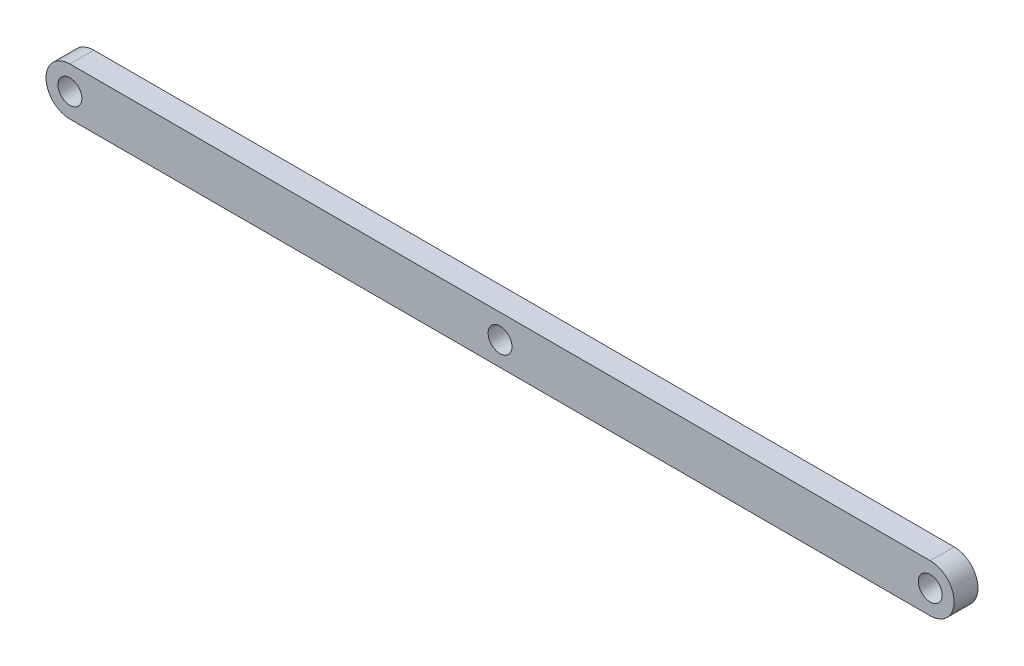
ISO-10303-21;
HEADER;
FILE_DESCRIPTION(('STEP AP214'),'2;1');
FILE_NAME('part.step','',(''),(''),'','','');
FILE_SCHEMA(('AUTOMOTIVE_DESIGN { 1 0 10303 214 1 1 1 1 }'));
ENDSEC;
DATA;
#1=APPLICATION_CONTEXT('core data for automotive mechanical design processes');
#2=APPLICATION_PROTOCOL_DEFINITION('international standard','automotive_design',2000,#1);
#3=PRODUCT_CONTEXT('',#1,'mechanical');
#4=PRODUCT('Part','Part','',(#3));
#5=PRODUCT_RELATED_PRODUCT_CATEGORY('part','',(#4));
#6=PRODUCT_DEFINITION_FORMATION('','',#4);
#7=PRODUCT_DEFINITION_CONTEXT('part definition',#1,'design');
#8=PRODUCT_DEFINITION('design','',#6,#7);
#9=PRODUCT_DEFINITION_SHAPE('','',#8);
#10=(LENGTH_UNIT() NAMED_UNIT(*) SI_UNIT(.MILLI.,.METRE.));
#11=(NAMED_UNIT(*) PLANE_ANGLE_UNIT() SI_UNIT($,.RADIAN.));
#12=(NAMED_UNIT(*) SI_UNIT($,.STERADIAN.) SOLID_ANGLE_UNIT());
#13=UNCERTAINTY_MEASURE_WITH_UNIT(LENGTH_MEASURE(1.E-05),#10,'distance_accuracy_value','');
#14=(GEOMETRIC_REPRESENTATION_CONTEXT(3) GLOBAL_UNCERTAINTY_ASSIGNED_CONTEXT((#13)) GLOBAL_UNIT_ASSIGNED_CONTEXT((#10,
#11,#12)) REPRESENTATION_CONTEXT('',''));
#15=CARTESIAN_POINT('',(0.,0.,0.));
#16=DIRECTION('',(0.,0.,1.));
#17=DIRECTION('',(1.,0.,0.));
#18=AXIS2_PLACEMENT_3D('',#15,#16,#17);
#19=CARTESIAN_POINT('',(0.,0.,3.175));
#20=DIRECTION('',(0.,0.,1.));
#21=DIRECTION('',(1.,0.,0.));
#22=AXIS2_PLACEMENT_3D('',#19,#20,#21);
#23=PLANE('',#22);
#24=CARTESIAN_POINT('',(114.3,0.,3.175));
#25=DIRECTION('',(0.,0.,1.));
#26=DIRECTION('',(1.,0.,0.));
#27=AXIS2_PLACEMENT_3D('',#24,#25,#26);
#28=CIRCLE('',#27,1.5875);
#29=CARTESIAN_POINT('',(115.8875,0.,3.175));
#30=VERTEX_POINT('',#29);
#31=EDGE_CURVE('E134',#30,#30,#28,.T.);
#32=ORIENTED_EDGE('',*,*,#31,.F.);
#33=EDGE_LOOP('',(#32));
#34=FACE_BOUND('',#33,.T.);
#35=CARTESIAN_POINT('',(0.,0.,3.175));
#36=DIRECTION('',(0.,0.,1.));
#37=DIRECTION('',(1.,0.,0.));
#38=AXIS2_PLACEMENT_3D('',#35,#36,#37);
#39=CIRCLE('',#38,3.175);
#40=CARTESIAN_POINT('',(0.,3.175,3.175));
#41=VERTEX_POINT('',#40);
#42=CARTESIAN_POINT('',(0.,-3.175,3.175));
#43=VERTEX_POINT('',#42);
#44=EDGE_CURVE('E92',#41,#43,#39,.T.);
#45=ORIENTED_EDGE('',*,*,#44,.T.);
#46=DIRECTION('',(1.,0.,0.));
#47=VECTOR('',#46,1.);
#48=CARTESIAN_POINT('',(0.,-3.175,3.175));
#49=LINE('',#48,#47);
#50=CARTESIAN_POINT('',(114.3,-3.175,3.175));
#51=VERTEX_POINT('',#50);
#52=EDGE_CURVE('E87',#43,#51,#49,.T.);
#53=ORIENTED_EDGE('',*,*,#52,.T.);
#54=CARTESIAN_POINT('',(114.3,0.,3.175));
#55=DIRECTION('',(0.,0.,1.));
#56=DIRECTION('',(1.,0.,0.));
#57=AXIS2_PLACEMENT_3D('',#54,#55,#56);
#58=CIRCLE('',#57,3.175);
#59=CARTESIAN_POINT('',(114.3,3.175,3.175));
#60=VERTEX_POINT('',#59);
#61=EDGE_CURVE('E90',#51,#60,#58,.T.);
#62=ORIENTED_EDGE('',*,*,#61,.T.);
#63=DIRECTION('',(-1.,0.,0.));
#64=VECTOR('',#63,1.);
#65=CARTESIAN_POINT('',(0.,3.175,3.175));
#66=LINE('',#65,#64);
#67=EDGE_CURVE('E57',#60,#41,#66,.T.);
#68=ORIENTED_EDGE('',*,*,#67,.T.);
#69=EDGE_LOOP('',(#45,#53,#62,#68));
#70=FACE_BOUND('',#69,.T.);
#71=CARTESIAN_POINT('',(0.,0.,3.175));
#72=DIRECTION('',(0.,0.,1.));
#73=DIRECTION('',(1.,0.,0.));
#74=AXIS2_PLACEMENT_3D('',#71,#72,#73);
#75=CIRCLE('',#74,1.5875);
#76=CARTESIAN_POINT('',(1.5875,0.,3.175));
#77=VERTEX_POINT('',#76);
#78=EDGE_CURVE('E112',#77,#77,#75,.T.);
#79=ORIENTED_EDGE('',*,*,#78,.F.);
#80=EDGE_LOOP('',(#79));
#81=FACE_BOUND('',#80,.T.);
#82=CARTESIAN_POINT('',(57.15,0.,3.175));
#83=DIRECTION('',(0.,0.,1.));
#84=DIRECTION('',(1.,0.,0.));
#85=AXIS2_PLACEMENT_3D('',#82,#83,#84);
#86=CIRCLE('',#85,1.5875);
#87=CARTESIAN_POINT('',(58.7375,0.,3.175));
#88=VERTEX_POINT('',#87);
#89=EDGE_CURVE('E142',#88,#88,#86,.T.);
#90=ORIENTED_EDGE('',*,*,#89,.F.);
#91=EDGE_LOOP('',(#90));
#92=FACE_BOUND('',#91,.T.);
#93=ADVANCED_FACE('F39',(#34,#70,#81,#92),#23,.T.);
#94=CARTESIAN_POINT('',(0.,0.,0.));
#95=DIRECTION('',(0.,0.,1.));
#96=DIRECTION('',(1.,0.,0.));
#97=AXIS2_PLACEMENT_3D('',#94,#95,#96);
#98=PLANE('',#97);
#99=CARTESIAN_POINT('',(0.,0.,0.));
#100=DIRECTION('',(0.,0.,1.));
#101=DIRECTION('',(1.,0.,0.));
#102=AXIS2_PLACEMENT_3D('',#99,#100,#101);
#103=CIRCLE('',#102,3.175);
#104=CARTESIAN_POINT('',(0.,3.175,0.));
#105=VERTEX_POINT('',#104);
#106=CARTESIAN_POINT('',(0.,-3.175,0.));
#107=VERTEX_POINT('',#106);
#108=EDGE_CURVE('E108',#105,#107,#103,.T.);
#109=ORIENTED_EDGE('',*,*,#108,.F.);
#110=DIRECTION('',(-1.,0.,0.));
#111=VECTOR('',#110,1.);
#112=CARTESIAN_POINT('',(0.,3.175,0.));
#113=LINE('',#112,#111);
#114=CARTESIAN_POINT('',(114.3,3.175,0.));
#115=VERTEX_POINT('',#114);
#116=EDGE_CURVE('E80',#115,#105,#113,.T.);
#117=ORIENTED_EDGE('',*,*,#116,.F.);
#118=CARTESIAN_POINT('',(114.3,0.,0.));
#119=DIRECTION('',(0.,0.,1.));
#120=DIRECTION('',(1.,0.,0.));
#121=AXIS2_PLACEMENT_3D('',#118,#119,#120);
#122=CIRCLE('',#121,3.175);
#123=CARTESIAN_POINT('',(114.3,-3.175,0.));
#124=VERTEX_POINT('',#123);
#125=EDGE_CURVE('E74',#124,#115,#122,.T.);
#126=ORIENTED_EDGE('',*,*,#125,.F.);
#127=DIRECTION('',(1.,0.,0.));
#128=VECTOR('',#127,1.);
#129=CARTESIAN_POINT('',(0.,-3.175,0.));
#130=LINE('',#129,#128);
#131=EDGE_CURVE('E97',#107,#124,#130,.T.);
#132=ORIENTED_EDGE('',*,*,#131,.F.);
#133=EDGE_LOOP('',(#109,#117,#126,#132));
#134=FACE_BOUND('',#133,.T.);
#135=CARTESIAN_POINT('',(0.,0.,0.));
#136=DIRECTION('',(0.,0.,1.));
#137=DIRECTION('',(1.,0.,0.));
#138=AXIS2_PLACEMENT_3D('',#135,#136,#137);
#139=CIRCLE('',#138,1.5875);
#140=CARTESIAN_POINT('',(1.5875,0.,0.));
#141=VERTEX_POINT('',#140);
#142=EDGE_CURVE('E130',#141,#141,#139,.T.);
#143=ORIENTED_EDGE('',*,*,#142,.T.);
#144=EDGE_LOOP('',(#143));
#145=FACE_BOUND('',#144,.T.);
#146=CARTESIAN_POINT('',(114.3,0.,0.));
#147=DIRECTION('',(0.,0.,1.));
#148=DIRECTION('',(1.,0.,0.));
#149=AXIS2_PLACEMENT_3D('',#146,#147,#148);
#150=CIRCLE('',#149,1.5875);
#151=CARTESIAN_POINT('',(115.8875,0.,0.));
#152=VERTEX_POINT('',#151);
#153=EDGE_CURVE('E138',#152,#152,#150,.T.);
#154=ORIENTED_EDGE('',*,*,#153,.T.);
#155=EDGE_LOOP('',(#154));
#156=FACE_BOUND('',#155,.T.);
#157=CARTESIAN_POINT('',(57.15,0.,0.));
#158=DIRECTION('',(0.,0.,1.));
#159=DIRECTION('',(1.,0.,0.));
#160=AXIS2_PLACEMENT_3D('',#157,#158,#159);
#161=CIRCLE('',#160,1.5875);
#162=CARTESIAN_POINT('',(58.7375,0.,0.));
#163=VERTEX_POINT('',#162);
#164=EDGE_CURVE('E146',#163,#163,#161,.T.);
#165=ORIENTED_EDGE('',*,*,#164,.T.);
#166=EDGE_LOOP('',(#165));
#167=FACE_BOUND('',#166,.T.);
#168=ADVANCED_FACE('F125',(#134,#145,#156,#167),#98,.F.);
#169=CARTESIAN_POINT('',(0.,0.,3.175));
#170=DIRECTION('',(0.,0.,-1.));
#171=DIRECTION('',(-1.,0.,0.));
#172=AXIS2_PLACEMENT_3D('',#169,#170,#171);
#173=CYLINDRICAL_SURFACE('',#172,3.175);
#174=ORIENTED_EDGE('',*,*,#108,.T.);
#175=DIRECTION('',(0.,0.,-1.));
#176=VECTOR('',#175,1.);
#177=CARTESIAN_POINT('',(0.,-3.175,3.175));
#178=LINE('',#177,#176);
#179=EDGE_CURVE('E11',#43,#107,#178,.T.);
#180=ORIENTED_EDGE('',*,*,#179,.F.);
#181=ORIENTED_EDGE('',*,*,#44,.F.);
#182=DIRECTION('',(0.,0.,-1.));
#183=VECTOR('',#182,1.);
#184=CARTESIAN_POINT('',(0.,3.175,3.175));
#185=LINE('',#184,#183);
#186=EDGE_CURVE('E104',#41,#105,#185,.T.);
#187=ORIENTED_EDGE('',*,*,#186,.T.);
#188=EDGE_LOOP('',(#174,#180,#181,#187));
#189=FACE_BOUND('',#188,.T.);
#190=ADVANCED_FACE('F41',(#189),#173,.T.);
#191=CARTESIAN_POINT('',(0.,-3.175,3.175));
#192=DIRECTION('',(0.,1.,0.));
#193=DIRECTION('',(0.,0.,1.));
#194=AXIS2_PLACEMENT_3D('',#191,#192,#193);
#195=PLANE('',#194);
#196=ORIENTED_EDGE('',*,*,#131,.T.);
#197=DIRECTION('',(0.,0.,-1.));
#198=VECTOR('',#197,1.);
#199=CARTESIAN_POINT('',(114.3,-3.175,3.175));
#200=LINE('',#199,#198);
#201=EDGE_CURVE('E49',#51,#124,#200,.T.);
#202=ORIENTED_EDGE('',*,*,#201,.F.);
#203=ORIENTED_EDGE('',*,*,#52,.F.);
#204=ORIENTED_EDGE('',*,*,#179,.T.);
#205=EDGE_LOOP('',(#196,#202,#203,#204));
#206=FACE_BOUND('',#205,.T.);
#207=ADVANCED_FACE('F96',(#206),#195,.F.);
#208=CARTESIAN_POINT('',(114.3,0.,3.175));
#209=DIRECTION('',(0.,0.,-1.));
#210=DIRECTION('',(-1.,0.,0.));
#211=AXIS2_PLACEMENT_3D('',#208,#209,#210);
#212=CYLINDRICAL_SURFACE('',#211,3.175);
#213=ORIENTED_EDGE('',*,*,#125,.T.);
#214=DIRECTION('',(0.,0.,-1.));
#215=VECTOR('',#214,1.);
#216=CARTESIAN_POINT('',(114.3,3.175,3.175));
#217=LINE('',#216,#215);
#218=EDGE_CURVE('E99',#60,#115,#217,.T.);
#219=ORIENTED_EDGE('',*,*,#218,.F.);
#220=ORIENTED_EDGE('',*,*,#61,.F.);
#221=ORIENTED_EDGE('',*,*,#201,.T.);
#222=EDGE_LOOP('',(#213,#219,#220,#221));
#223=FACE_BOUND('',#222,.T.);
#224=ADVANCED_FACE('F100',(#223),#212,.T.);
#225=CARTESIAN_POINT('',(0.,3.175,3.175));
#226=DIRECTION('',(0.,-1.,0.));
#227=DIRECTION('',(0.,0.,-1.));
#228=AXIS2_PLACEMENT_3D('',#225,#226,#227);
#229=PLANE('',#228);
#230=ORIENTED_EDGE('',*,*,#116,.T.);
#231=ORIENTED_EDGE('',*,*,#186,.F.);
#232=ORIENTED_EDGE('',*,*,#67,.F.);
#233=ORIENTED_EDGE('',*,*,#218,.T.);
#234=EDGE_LOOP('',(#230,#231,#232,#233));
#235=FACE_BOUND('',#234,.T.);
#236=ADVANCED_FACE('F122',(#235),#229,.F.);
#237=CARTESIAN_POINT('',(0.,0.,3.175));
#238=DIRECTION('',(0.,0.,-1.));
#239=DIRECTION('',(-1.,0.,0.));
#240=AXIS2_PLACEMENT_3D('',#237,#238,#239);
#241=CYLINDRICAL_SURFACE('',#240,1.5875);
#242=ORIENTED_EDGE('',*,*,#78,.T.);
#243=EDGE_LOOP('',(#242));
#244=FACE_BOUND('',#243,.T.);
#245=ORIENTED_EDGE('',*,*,#142,.F.);
#246=EDGE_LOOP('',(#245));
#247=FACE_BOUND('',#246,.T.);
#248=ADVANCED_FACE('F166',(#244,#247),#241,.F.);
#249=CARTESIAN_POINT('',(114.3,0.,3.175));
#250=DIRECTION('',(0.,0.,-1.));
#251=DIRECTION('',(-1.,0.,0.));
#252=AXIS2_PLACEMENT_3D('',#249,#250,#251);
#253=CYLINDRICAL_SURFACE('',#252,1.5875);
#254=ORIENTED_EDGE('',*,*,#31,.T.);
#255=EDGE_LOOP('',(#254));
#256=FACE_BOUND('',#255,.T.);
#257=ORIENTED_EDGE('',*,*,#153,.F.);
#258=EDGE_LOOP('',(#257));
#259=FACE_BOUND('',#258,.T.);
#260=ADVANCED_FACE('F212',(#256,#259),#253,.F.);
#261=CARTESIAN_POINT('',(57.15,0.,3.175));
#262=DIRECTION('',(0.,0.,-1.));
#263=DIRECTION('',(-1.,0.,0.));
#264=AXIS2_PLACEMENT_3D('',#261,#262,#263);
#265=CYLINDRICAL_SURFACE('',#264,1.5875);
#266=ORIENTED_EDGE('',*,*,#89,.T.);
#267=EDGE_LOOP('',(#266));
#268=FACE_BOUND('',#267,.T.);
#269=ORIENTED_EDGE('',*,*,#164,.F.);
#270=EDGE_LOOP('',(#269));
#271=FACE_BOUND('',#270,.T.);
#272=ADVANCED_FACE('F154',(#268,#271),#265,.F.);
#273=CLOSED_SHELL('',(#93,#168,#190,#207,#224,#236,#248,#260,#272));
#274=MANIFOLD_SOLID_BREP('B2',#273);
#275=ADVANCED_BREP_SHAPE_REPRESENTATION('',(#18,#274),#14);
#276=SHAPE_DEFINITION_REPRESENTATION(#9,#275);
ENDSEC;
END-ISO-10303-21;
